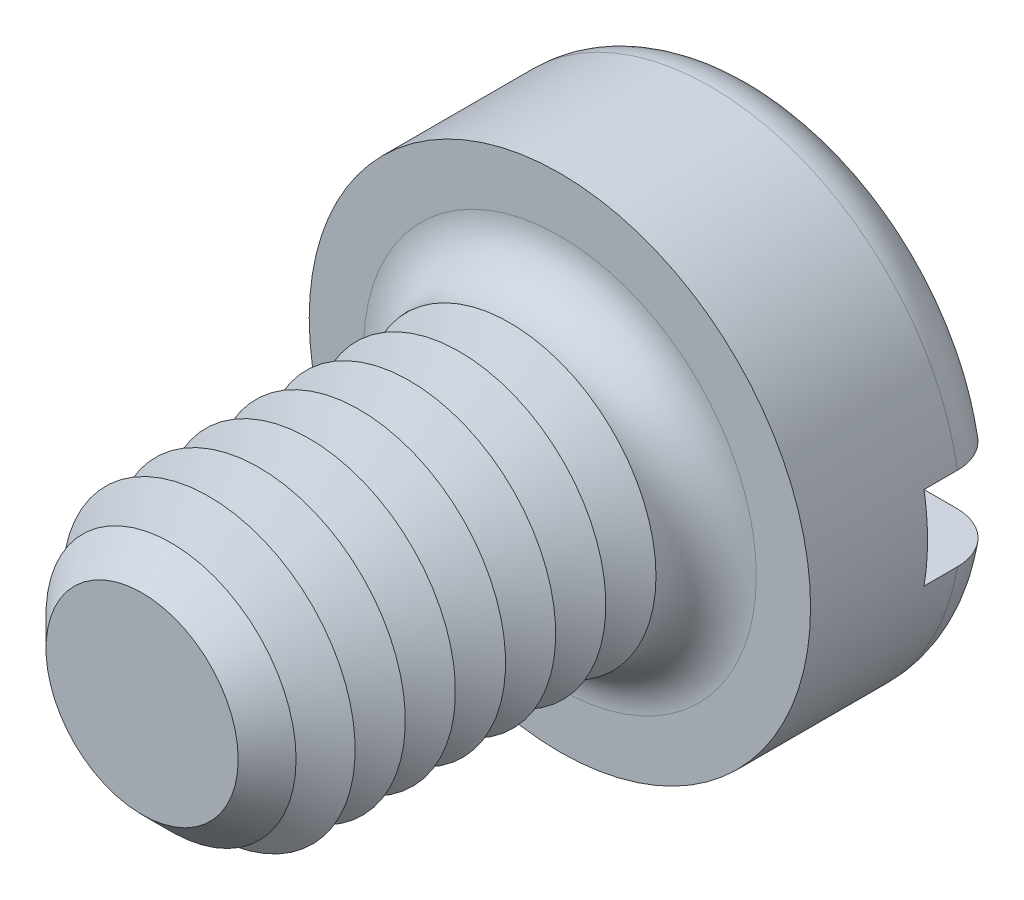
from build123d import *

# Parameters (mm, degrees)
SKETCH3_R           = 3
BOSS_EXTRUDE2_DEPTH = 2.4
SKETCH4_R           = 1.75
BOSS_EXTRUDE3_DEPTH = 5
FILLET1_R           = 0.6
CHAMFER1_SIZE       = 0.6
LPATTERN1_COUNT     = 7
LPATTERN1_PITCH     = 0.6
SKETCH8_W           = 6
SKETCH8_H           = 1
CUT_EXTRUDE1_DEPTH  = 1


with BuildPart() as part:
    # Sketch3 → Boss-Extrude2 (new body)
    with BuildSketch(Plane.XY):
        Circle(SKETCH3_R)
    extrude(amount=-BOSS_EXTRUDE2_DEPTH)

    # Sketch4 → Boss-Extrude3 (add)
    with BuildSketch(Plane.XY):
        Circle(SKETCH4_R)
    extrude(amount=BOSS_EXTRUDE3_DEPTH)

    # Fillet1
    fillet1_edges = [part.edges().sort_by_distance(p)[0] for p in [
        (-3, 0, -2.4),
        (-1.75, 0, 0),
    ]]
    fillet(fillet1_edges, radius=FILLET1_R)

    # Chamfer1
    chamfer1_edges = [part.edges().sort_by_distance(p)[0] for p in [
        (-1.75, 0, 5),
    ]]
    chamfer(chamfer1_edges, length=CHAMFER1_SIZE)

    # Sketch6 → Cut-Revolve1 (revolve, cut)
    with BuildSketch(Plane(origin=(0, 0, 0), x_dir=(0, 0, -1), z_dir=(1, 0, 0)), mode=Mode.PRIVATE) as cut_revolve1_sk:
        Polygon((-0.6, 1.75), (-0.9, 1.230384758), (-1.2, 1.75), align=None)
    cut_revolve1 = revolve(cut_revolve1_sk.sketch.rotate(Axis((0, 0, -1.694361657), (0, 0, 1)), 90), axis=Axis((0, 0, -1.694361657), (0, 0, 1)), mode=Mode.SUBTRACT)

    # LPattern1: Cut-Revolve1 ×7
    with Locations(*[(0, 0, i * LPATTERN1_PITCH) for i in range(1, LPATTERN1_COUNT)]):
        add(cut_revolve1, mode=Mode.SUBTRACT)

    # Sketch8 → Cut-Extrude1 (cut)
    with BuildSketch(Plane(origin=(0, 0, -2.4), x_dir=(-1, 0, 0), z_dir=(0, 0, -1))):
        Rectangle(SKETCH8_W, SKETCH8_H)
    extrude(amount=-CUT_EXTRUDE1_DEPTH, mode=Mode.SUBTRACT)


solid = part.part
